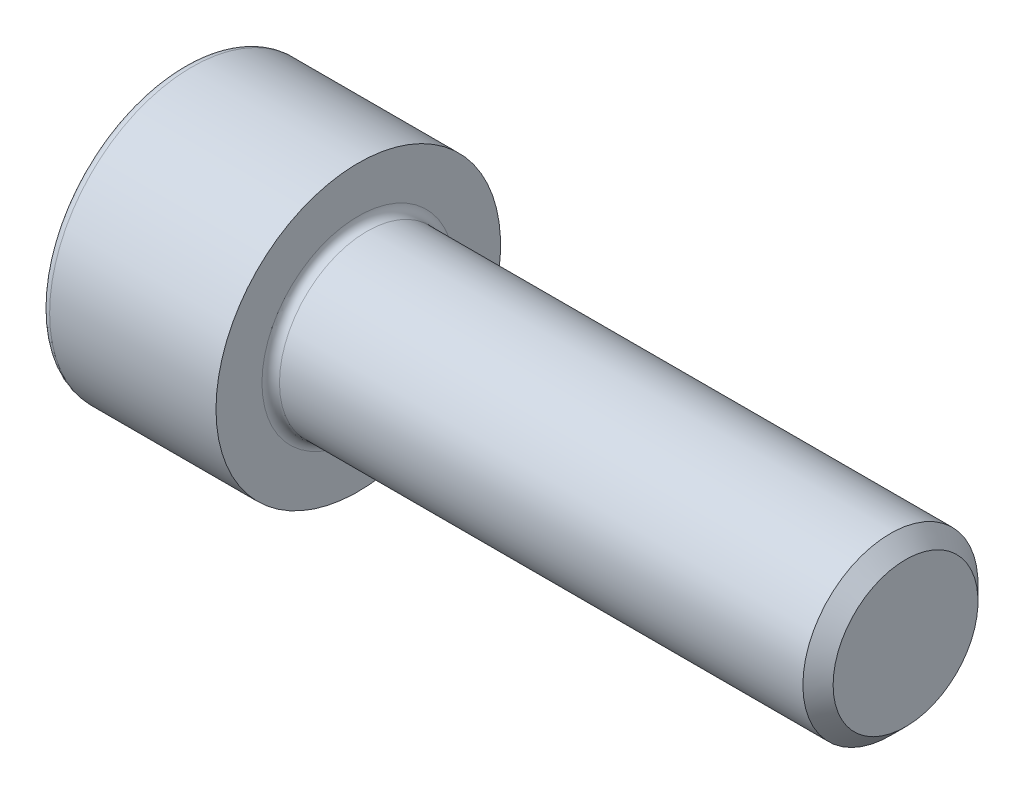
ISO-10303-21;
HEADER;
FILE_DESCRIPTION(('STEP AP214'),'2;1');
FILE_NAME('part.step','',(''),(''),'','','');
FILE_SCHEMA(('AUTOMOTIVE_DESIGN { 1 0 10303 214 1 1 1 1 }'));
ENDSEC;
DATA;
#1=APPLICATION_CONTEXT('core data for automotive mechanical design processes');
#2=APPLICATION_PROTOCOL_DEFINITION('international standard','automotive_design',2000,#1);
#3=PRODUCT_CONTEXT('',#1,'mechanical');
#4=PRODUCT('Part','Part','',(#3));
#5=PRODUCT_RELATED_PRODUCT_CATEGORY('part','',(#4));
#6=PRODUCT_DEFINITION_FORMATION('','',#4);
#7=PRODUCT_DEFINITION_CONTEXT('part definition',#1,'design');
#8=PRODUCT_DEFINITION('design','',#6,#7);
#9=PRODUCT_DEFINITION_SHAPE('','',#8);
#10=(LENGTH_UNIT() NAMED_UNIT(*) SI_UNIT(.MILLI.,.METRE.));
#11=(NAMED_UNIT(*) PLANE_ANGLE_UNIT() SI_UNIT($,.RADIAN.));
#12=(NAMED_UNIT(*) SI_UNIT($,.STERADIAN.) SOLID_ANGLE_UNIT());
#13=UNCERTAINTY_MEASURE_WITH_UNIT(LENGTH_MEASURE(1.E-05),#10,'distance_accuracy_value','');
#14=(GEOMETRIC_REPRESENTATION_CONTEXT(3) GLOBAL_UNCERTAINTY_ASSIGNED_CONTEXT((#13)) GLOBAL_UNIT_ASSIGNED_CONTEXT((#10,
#11,#12)) REPRESENTATION_CONTEXT('',''));
#15=CARTESIAN_POINT('',(0.,0.,0.));
#16=DIRECTION('',(0.,0.,1.));
#17=DIRECTION('',(1.,0.,0.));
#18=AXIS2_PLACEMENT_3D('',#15,#16,#17);
#19=CARTESIAN_POINT('',(0.,0.,0.));
#20=DIRECTION('',(-1.,0.,0.));
#21=DIRECTION('',(0.,0.,1.));
#22=AXIS2_PLACEMENT_3D('',#19,#20,#21);
#23=PLANE('',#22);
#24=DIRECTION('',(0.,-0.499999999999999,0.866025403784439));
#25=VECTOR('',#24,1.);
#26=CARTESIAN_POINT('',(0.,3.51894989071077,0.));
#27=LINE('',#26,#25);
#28=CARTESIAN_POINT('',(0.,3.51894989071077,0.));
#29=VERTEX_POINT('',#28);
#30=CARTESIAN_POINT('',(0.,1.75947494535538,3.04749999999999));
#31=VERTEX_POINT('',#30);
#32=EDGE_CURVE('E259',#29,#31,#27,.T.);
#33=ORIENTED_EDGE('',*,*,#32,.T.);
#34=DIRECTION('',(0.,1.,0.));
#35=VECTOR('',#34,1.);
#36=CARTESIAN_POINT('',(0.,-1.75947494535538,3.0475));
#37=LINE('',#36,#35);
#38=CARTESIAN_POINT('',(0.,-1.75947494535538,3.0475));
#39=VERTEX_POINT('',#38);
#40=EDGE_CURVE('E131',#39,#31,#37,.T.);
#41=ORIENTED_EDGE('',*,*,#40,.F.);
#42=DIRECTION('',(0.,-0.500000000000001,-0.866025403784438));
#43=VECTOR('',#42,1.);
#44=CARTESIAN_POINT('',(0.,-1.75947494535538,3.0475));
#45=LINE('',#44,#43);
#46=CARTESIAN_POINT('',(0.,-3.51894989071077,0.));
#47=VERTEX_POINT('',#46);
#48=EDGE_CURVE('E262',#39,#47,#45,.T.);
#49=ORIENTED_EDGE('',*,*,#48,.T.);
#50=DIRECTION('',(0.,0.499999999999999,-0.866025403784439));
#51=VECTOR('',#50,1.);
#52=CARTESIAN_POINT('',(0.,-3.51894989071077,0.));
#53=LINE('',#52,#51);
#54=CARTESIAN_POINT('',(0.,-1.75947494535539,-3.0475));
#55=VERTEX_POINT('',#54);
#56=EDGE_CURVE('E265',#47,#55,#53,.T.);
#57=ORIENTED_EDGE('',*,*,#56,.T.);
#58=DIRECTION('',(0.,-1.,0.));
#59=VECTOR('',#58,1.);
#60=CARTESIAN_POINT('',(0.,1.75947494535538,-3.04750000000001));
#61=LINE('',#60,#59);
#62=CARTESIAN_POINT('',(0.,1.75947494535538,-3.04750000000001));
#63=VERTEX_POINT('',#62);
#64=EDGE_CURVE('E268',#63,#55,#61,.T.);
#65=ORIENTED_EDGE('',*,*,#64,.F.);
#66=DIRECTION('',(0.,-0.500000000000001,-0.866025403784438));
#67=VECTOR('',#66,1.);
#68=CARTESIAN_POINT('',(0.,3.51894989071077,0.));
#69=LINE('',#68,#67);
#70=EDGE_CURVE('E126',#29,#63,#69,.T.);
#71=ORIENTED_EDGE('',*,*,#70,.F.);
#72=EDGE_LOOP('',(#33,#41,#49,#57,#65,#71));
#73=FACE_BOUND('',#72,.T.);
#74=CARTESIAN_POINT('',(0.,0.,0.));
#75=DIRECTION('',(-1.,0.,0.));
#76=DIRECTION('',(0.,0.,1.));
#77=AXIS2_PLACEMENT_3D('',#74,#75,#76);
#78=CIRCLE('',#77,6.1);
#79=CARTESIAN_POINT('',(0.,0.,6.1));
#80=VERTEX_POINT('',#79);
#81=EDGE_CURVE('E43',#80,#80,#78,.T.);
#82=ORIENTED_EDGE('',*,*,#81,.T.);
#83=EDGE_LOOP('',(#82));
#84=FACE_BOUND('',#83,.T.);
#85=ADVANCED_FACE('F35',(#73,#84),#23,.T.);
#86=CARTESIAN_POINT('',(-31.75,0.,0.));
#87=DIRECTION('',(-1.,0.,0.));
#88=DIRECTION('',(0.,0.,1.));
#89=AXIS2_PLACEMENT_3D('',#86,#87,#88);
#90=CYLINDRICAL_SURFACE('',#89,6.5);
#91=CARTESIAN_POINT('',(0.399999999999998,0.,0.));
#92=DIRECTION('',(-1.,0.,0.));
#93=DIRECTION('',(0.,0.,1.));
#94=AXIS2_PLACEMENT_3D('',#91,#92,#93);
#95=CIRCLE('',#94,6.5);
#96=CARTESIAN_POINT('',(0.399999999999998,0.,6.5));
#97=VERTEX_POINT('',#96);
#98=EDGE_CURVE('E11',#97,#97,#95,.F.);
#99=ORIENTED_EDGE('',*,*,#98,.T.);
#100=EDGE_LOOP('',(#99));
#101=FACE_BOUND('',#100,.T.);
#102=CARTESIAN_POINT('',(8.,0.,0.));
#103=DIRECTION('',(-1.,0.,0.));
#104=DIRECTION('',(0.,0.,1.));
#105=AXIS2_PLACEMENT_3D('',#102,#103,#104);
#106=CIRCLE('',#105,6.5);
#107=CARTESIAN_POINT('',(8.,0.,6.5));
#108=VERTEX_POINT('',#107);
#109=EDGE_CURVE('E149',#108,#108,#106,.T.);
#110=ORIENTED_EDGE('',*,*,#109,.T.);
#111=EDGE_LOOP('',(#110));
#112=FACE_BOUND('',#111,.T.);
#113=ADVANCED_FACE('F173',(#101,#112),#90,.T.);
#114=CARTESIAN_POINT('',(8.,6.5,0.));
#115=DIRECTION('',(1.,0.,0.));
#116=DIRECTION('',(0.,0.,-1.));
#117=AXIS2_PLACEMENT_3D('',#114,#115,#116);
#118=PLANE('',#117);
#119=CARTESIAN_POINT('',(8.,0.,0.));
#120=DIRECTION('',(1.,0.,0.));
#121=DIRECTION('',(0.,0.,-1.));
#122=AXIS2_PLACEMENT_3D('',#119,#120,#121);
#123=CIRCLE('',#122,4.39999999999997);
#124=CARTESIAN_POINT('',(8.,0.,-4.39999999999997));
#125=VERTEX_POINT('',#124);
#126=EDGE_CURVE('E152',#125,#125,#123,.F.);
#127=ORIENTED_EDGE('',*,*,#126,.T.);
#128=EDGE_LOOP('',(#127));
#129=FACE_BOUND('',#128,.T.);
#130=ORIENTED_EDGE('',*,*,#109,.F.);
#131=EDGE_LOOP('',(#130));
#132=FACE_BOUND('',#131,.T.);
#133=ADVANCED_FACE('F179',(#129,#132),#118,.T.);
#134=CARTESIAN_POINT('',(-31.75,0.,0.));
#135=DIRECTION('',(-1.,0.,0.));
#136=DIRECTION('',(0.,0.,1.));
#137=AXIS2_PLACEMENT_3D('',#134,#135,#136);
#138=CYLINDRICAL_SURFACE('',#137,3.99999999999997);
#139=CARTESIAN_POINT('',(8.4,0.,0.));
#140=DIRECTION('',(1.,0.,0.));
#141=DIRECTION('',(0.,0.,-1.));
#142=AXIS2_PLACEMENT_3D('',#139,#140,#141);
#143=CIRCLE('',#142,3.99999999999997);
#144=CARTESIAN_POINT('',(8.4,0.,-3.99999999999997));
#145=VERTEX_POINT('',#144);
#146=EDGE_CURVE('E155',#145,#145,#143,.T.);
#147=ORIENTED_EDGE('',*,*,#146,.T.);
#148=EDGE_LOOP('',(#147));
#149=FACE_BOUND('',#148,.T.);
#150=CARTESIAN_POINT('',(32.3095,0.,0.));
#151=DIRECTION('',(-1.,0.,0.));
#152=DIRECTION('',(0.,0.,1.));
#153=AXIS2_PLACEMENT_3D('',#150,#151,#152);
#154=CIRCLE('',#153,3.99999999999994);
#155=CARTESIAN_POINT('',(32.3095,0.,3.99999999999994));
#156=VERTEX_POINT('',#155);
#157=EDGE_CURVE('E146',#156,#156,#154,.T.);
#158=ORIENTED_EDGE('',*,*,#157,.T.);
#159=EDGE_LOOP('',(#158));
#160=FACE_BOUND('',#159,.T.);
#161=ADVANCED_FACE('F185',(#149,#160),#138,.T.);
#162=CARTESIAN_POINT('',(33.,0.,0.));
#163=DIRECTION('',(-1.,0.,0.));
#164=DIRECTION('',(0.,0.,1.));
#165=AXIS2_PLACEMENT_3D('',#162,#163,#164);
#166=CONICAL_SURFACE('',#165,3.3095,0.785398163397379);
#167=ORIENTED_EDGE('',*,*,#157,.F.);
#168=EDGE_LOOP('',(#167));
#169=FACE_BOUND('',#168,.T.);
#170=CARTESIAN_POINT('',(33.,0.,0.));
#171=DIRECTION('',(-1.,0.,0.));
#172=DIRECTION('',(0.,0.,1.));
#173=AXIS2_PLACEMENT_3D('',#170,#171,#172);
#174=CIRCLE('',#173,3.3095);
#175=CARTESIAN_POINT('',(33.,0.,3.3095));
#176=VERTEX_POINT('',#175);
#177=EDGE_CURVE('E142',#176,#176,#174,.T.);
#178=ORIENTED_EDGE('',*,*,#177,.T.);
#179=EDGE_LOOP('',(#178));
#180=FACE_BOUND('',#179,.T.);
#181=ADVANCED_FACE('F189',(#169,#180),#166,.T.);
#182=CARTESIAN_POINT('',(33.,3.3095,0.));
#183=DIRECTION('',(1.,0.,0.));
#184=DIRECTION('',(0.,0.,-1.));
#185=AXIS2_PLACEMENT_3D('',#182,#183,#184);
#186=PLANE('',#185);
#187=ORIENTED_EDGE('',*,*,#177,.F.);
#188=EDGE_LOOP('',(#187));
#189=FACE_BOUND('',#188,.T.);
#190=ADVANCED_FACE('F169',(#189),#186,.T.);
#191=CARTESIAN_POINT('',(8.4,0.,0.));
#192=DIRECTION('',(1.,0.,0.));
#193=DIRECTION('',(0.,0.,-1.));
#194=AXIS2_PLACEMENT_3D('',#191,#192,#193);
#195=TOROIDAL_SURFACE('',#194,4.39999999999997,0.4);
#196=ORIENTED_EDGE('',*,*,#146,.F.);
#197=EDGE_LOOP('',(#196));
#198=FACE_BOUND('',#197,.T.);
#199=ORIENTED_EDGE('',*,*,#126,.F.);
#200=EDGE_LOOP('',(#199));
#201=FACE_BOUND('',#200,.T.);
#202=ADVANCED_FACE('F162',(#198,#201),#195,.F.);
#203=CARTESIAN_POINT('',(0.399999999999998,0.,0.));
#204=DIRECTION('',(-1.,0.,0.));
#205=DIRECTION('',(0.,0.,1.));
#206=AXIS2_PLACEMENT_3D('',#203,#204,#205);
#207=TOROIDAL_SURFACE('',#206,6.1,0.4);
#208=ORIENTED_EDGE('',*,*,#98,.F.);
#209=EDGE_LOOP('',(#208));
#210=FACE_BOUND('',#209,.T.);
#211=ORIENTED_EDGE('',*,*,#81,.F.);
#212=EDGE_LOOP('',(#211));
#213=FACE_BOUND('',#212,.T.);
#214=ADVANCED_FACE('F37',(#210,#213),#207,.T.);
#215=CARTESIAN_POINT('',(4.,3.51894989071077,0.));
#216=DIRECTION('',(0.,-0.866025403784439,-0.499999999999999));
#217=DIRECTION('',(0.,0.499999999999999,-0.866025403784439));
#218=AXIS2_PLACEMENT_3D('',#215,#216,#217);
#219=PLANE('',#218);
#220=ORIENTED_EDGE('',*,*,#32,.F.);
#221=DIRECTION('',(-1.,0.,0.));
#222=VECTOR('',#221,1.);
#223=CARTESIAN_POINT('',(4.,3.51894989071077,0.));
#224=LINE('',#223,#222);
#225=CARTESIAN_POINT('',(4.,3.51894989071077,0.));
#226=VERTEX_POINT('',#225);
#227=EDGE_CURVE('E249',#226,#29,#224,.T.);
#228=ORIENTED_EDGE('',*,*,#227,.F.);
#229=DIRECTION('',(0.,-0.499999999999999,0.866025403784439));
#230=VECTOR('',#229,1.);
#231=CARTESIAN_POINT('',(4.,3.51894989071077,0.));
#232=LINE('',#231,#230);
#233=CARTESIAN_POINT('',(4.,2.63921241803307,1.52374999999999));
#234=VERTEX_POINT('',#233);
#235=EDGE_CURVE('E118',#226,#234,#232,.T.);
#236=ORIENTED_EDGE('',*,*,#235,.T.);
#237=CARTESIAN_POINT('',(4.,1.75947494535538,3.04749999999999));
#238=VERTEX_POINT('',#237);
#239=EDGE_CURVE('E109',#234,#238,#232,.T.);
#240=ORIENTED_EDGE('',*,*,#239,.T.);
#241=DIRECTION('',(-1.,0.,0.));
#242=VECTOR('',#241,1.);
#243=CARTESIAN_POINT('',(4.,1.75947494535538,3.04749999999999));
#244=LINE('',#243,#242);
#245=EDGE_CURVE('E123',#238,#31,#244,.T.);
#246=ORIENTED_EDGE('',*,*,#245,.T.);
#247=EDGE_LOOP('',(#220,#228,#236,#240,#246));
#248=FACE_BOUND('',#247,.T.);
#249=ADVANCED_FACE('F122',(#248),#219,.T.);
#250=CARTESIAN_POINT('',(4.,-1.75947494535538,3.0475));
#251=DIRECTION('',(0.,0.,1.));
#252=DIRECTION('',(0.,-1.,0.));
#253=AXIS2_PLACEMENT_3D('',#250,#251,#252);
#254=PLANE('',#253);
#255=ORIENTED_EDGE('',*,*,#40,.T.);
#256=ORIENTED_EDGE('',*,*,#245,.F.);
#257=DIRECTION('',(0.,1.,0.));
#258=VECTOR('',#257,1.);
#259=CARTESIAN_POINT('',(4.,-1.75947494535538,3.0475));
#260=LINE('',#259,#258);
#261=CARTESIAN_POINT('',(4.,0.,3.0475));
#262=VERTEX_POINT('',#261);
#263=EDGE_CURVE('E106',#262,#238,#260,.T.);
#264=ORIENTED_EDGE('',*,*,#263,.F.);
#265=CARTESIAN_POINT('',(4.,-1.75947494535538,3.0475));
#266=VERTEX_POINT('',#265);
#267=EDGE_CURVE('E117',#266,#262,#260,.T.);
#268=ORIENTED_EDGE('',*,*,#267,.F.);
#269=DIRECTION('',(-1.,0.,0.));
#270=VECTOR('',#269,1.);
#271=CARTESIAN_POINT('',(4.,-1.75947494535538,3.0475));
#272=LINE('',#271,#270);
#273=EDGE_CURVE('E133',#266,#39,#272,.T.);
#274=ORIENTED_EDGE('',*,*,#273,.T.);
#275=EDGE_LOOP('',(#255,#256,#264,#268,#274));
#276=FACE_BOUND('',#275,.T.);
#277=ADVANCED_FACE('F128',(#276),#254,.F.);
#278=CARTESIAN_POINT('',(4.,-1.75947494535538,3.0475));
#279=DIRECTION('',(0.,0.866025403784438,-0.500000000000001));
#280=DIRECTION('',(0.,0.500000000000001,0.866025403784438));
#281=AXIS2_PLACEMENT_3D('',#278,#279,#280);
#282=PLANE('',#281);
#283=ORIENTED_EDGE('',*,*,#48,.F.);
#284=ORIENTED_EDGE('',*,*,#273,.F.);
#285=DIRECTION('',(0.,-0.500000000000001,-0.866025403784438));
#286=VECTOR('',#285,1.);
#287=CARTESIAN_POINT('',(4.,-1.75947494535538,3.0475));
#288=LINE('',#287,#286);
#289=CARTESIAN_POINT('',(4.,-2.63921241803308,1.52375));
#290=VERTEX_POINT('',#289);
#291=EDGE_CURVE('E288',#266,#290,#288,.T.);
#292=ORIENTED_EDGE('',*,*,#291,.T.);
#293=CARTESIAN_POINT('',(4.,-3.51894989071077,0.));
#294=VERTEX_POINT('',#293);
#295=EDGE_CURVE('E277',#290,#294,#288,.T.);
#296=ORIENTED_EDGE('',*,*,#295,.T.);
#297=DIRECTION('',(-1.,0.,0.));
#298=VECTOR('',#297,1.);
#299=CARTESIAN_POINT('',(4.,-3.51894989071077,0.));
#300=LINE('',#299,#298);
#301=EDGE_CURVE('E138',#294,#47,#300,.T.);
#302=ORIENTED_EDGE('',*,*,#301,.T.);
#303=EDGE_LOOP('',(#283,#284,#292,#296,#302));
#304=FACE_BOUND('',#303,.T.);
#305=ADVANCED_FACE('F203',(#304),#282,.T.);
#306=CARTESIAN_POINT('',(4.,-3.51894989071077,0.));
#307=DIRECTION('',(0.,0.86602540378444,0.499999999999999));
#308=DIRECTION('',(0.,-0.499999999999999,0.866025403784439));
#309=AXIS2_PLACEMENT_3D('',#306,#307,#308);
#310=PLANE('',#309);
#311=ORIENTED_EDGE('',*,*,#56,.F.);
#312=ORIENTED_EDGE('',*,*,#301,.F.);
#313=DIRECTION('',(0.,0.499999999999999,-0.866025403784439));
#314=VECTOR('',#313,1.);
#315=CARTESIAN_POINT('',(4.,-3.51894989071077,0.));
#316=LINE('',#315,#314);
#317=CARTESIAN_POINT('',(4.,-2.63921241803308,-1.52375));
#318=VERTEX_POINT('',#317);
#319=EDGE_CURVE('E255',#294,#318,#316,.T.);
#320=ORIENTED_EDGE('',*,*,#319,.T.);
#321=CARTESIAN_POINT('',(4.,-1.75947494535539,-3.0475));
#322=VERTEX_POINT('',#321);
#323=EDGE_CURVE('E287',#318,#322,#316,.T.);
#324=ORIENTED_EDGE('',*,*,#323,.T.);
#325=DIRECTION('',(-1.,0.,0.));
#326=VECTOR('',#325,1.);
#327=CARTESIAN_POINT('',(4.,-1.75947494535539,-3.0475));
#328=LINE('',#327,#326);
#329=EDGE_CURVE('E248',#322,#55,#328,.T.);
#330=ORIENTED_EDGE('',*,*,#329,.T.);
#331=EDGE_LOOP('',(#311,#312,#320,#324,#330));
#332=FACE_BOUND('',#331,.T.);
#333=ADVANCED_FACE('F206',(#332),#310,.T.);
#334=CARTESIAN_POINT('',(4.,1.75947494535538,-3.04750000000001));
#335=DIRECTION('',(0.,0.,-1.));
#336=DIRECTION('',(0.,1.,0.));
#337=AXIS2_PLACEMENT_3D('',#334,#335,#336);
#338=PLANE('',#337);
#339=ORIENTED_EDGE('',*,*,#64,.T.);
#340=ORIENTED_EDGE('',*,*,#329,.F.);
#341=DIRECTION('',(0.,-1.,0.));
#342=VECTOR('',#341,1.);
#343=CARTESIAN_POINT('',(4.,1.75947494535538,-3.04750000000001));
#344=LINE('',#343,#342);
#345=CARTESIAN_POINT('',(4.,0.,-3.0475));
#346=VERTEX_POINT('',#345);
#347=EDGE_CURVE('E252',#346,#322,#344,.T.);
#348=ORIENTED_EDGE('',*,*,#347,.F.);
#349=CARTESIAN_POINT('',(4.,1.75947494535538,-3.04750000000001));
#350=VERTEX_POINT('',#349);
#351=EDGE_CURVE('E50',#350,#346,#344,.T.);
#352=ORIENTED_EDGE('',*,*,#351,.F.);
#353=DIRECTION('',(-1.,0.,0.));
#354=VECTOR('',#353,1.);
#355=CARTESIAN_POINT('',(4.,1.75947494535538,-3.04750000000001));
#356=LINE('',#355,#354);
#357=EDGE_CURVE('E245',#350,#63,#356,.T.);
#358=ORIENTED_EDGE('',*,*,#357,.T.);
#359=EDGE_LOOP('',(#339,#340,#348,#352,#358));
#360=FACE_BOUND('',#359,.T.);
#361=ADVANCED_FACE('F210',(#360),#338,.F.);
#362=CARTESIAN_POINT('',(4.,3.51894989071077,0.));
#363=DIRECTION('',(0.,0.866025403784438,-0.500000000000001));
#364=DIRECTION('',(0.,0.500000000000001,0.866025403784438));
#365=AXIS2_PLACEMENT_3D('',#362,#363,#364);
#366=PLANE('',#365);
#367=ORIENTED_EDGE('',*,*,#70,.T.);
#368=ORIENTED_EDGE('',*,*,#357,.F.);
#369=DIRECTION('',(0.,-0.500000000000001,-0.866025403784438));
#370=VECTOR('',#369,1.);
#371=CARTESIAN_POINT('',(4.,3.51894989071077,0.));
#372=LINE('',#371,#370);
#373=CARTESIAN_POINT('',(4.,2.63921241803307,-1.52375));
#374=VERTEX_POINT('',#373);
#375=EDGE_CURVE('E235',#374,#350,#372,.T.);
#376=ORIENTED_EDGE('',*,*,#375,.F.);
#377=EDGE_CURVE('E241',#226,#374,#372,.T.);
#378=ORIENTED_EDGE('',*,*,#377,.F.);
#379=ORIENTED_EDGE('',*,*,#227,.T.);
#380=EDGE_LOOP('',(#367,#368,#376,#378,#379));
#381=FACE_BOUND('',#380,.T.);
#382=ADVANCED_FACE('F214',(#381),#366,.F.);
#383=CARTESIAN_POINT('',(4.,5.27842483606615,-3.04750000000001));
#384=DIRECTION('',(1.,0.,0.));
#385=DIRECTION('',(0.,0.,-1.));
#386=AXIS2_PLACEMENT_3D('',#383,#384,#385);
#387=PLANE('',#386);
#388=ORIENTED_EDGE('',*,*,#347,.T.);
#389=ORIENTED_EDGE('',*,*,#323,.F.);
#390=CARTESIAN_POINT('',(4.,0.,0.));
#391=DIRECTION('',(-1.,0.,0.));
#392=DIRECTION('',(0.,0.,1.));
#393=AXIS2_PLACEMENT_3D('',#390,#391,#392);
#394=CIRCLE('',#393,3.0475);
#395=EDGE_CURVE('E283',#346,#318,#394,.T.);
#396=ORIENTED_EDGE('',*,*,#395,.F.);
#397=EDGE_LOOP('',(#388,#389,#396));
#398=FACE_BOUND('',#397,.T.);
#399=ADVANCED_FACE('F218',(#398),#387,.F.);
#400=ORIENTED_EDGE('',*,*,#319,.F.);
#401=ORIENTED_EDGE('',*,*,#295,.F.);
#402=EDGE_CURVE('E136',#318,#290,#394,.T.);
#403=ORIENTED_EDGE('',*,*,#402,.F.);
#404=EDGE_LOOP('',(#400,#401,#403));
#405=FACE_BOUND('',#404,.T.);
#406=ADVANCED_FACE('F221',(#405),#387,.F.);
#407=ORIENTED_EDGE('',*,*,#291,.F.);
#408=ORIENTED_EDGE('',*,*,#267,.T.);
#409=EDGE_CURVE('E132',#290,#262,#394,.T.);
#410=ORIENTED_EDGE('',*,*,#409,.F.);
#411=EDGE_LOOP('',(#407,#408,#410));
#412=FACE_BOUND('',#411,.T.);
#413=ADVANCED_FACE('F226',(#412),#387,.F.);
#414=ORIENTED_EDGE('',*,*,#263,.T.);
#415=ORIENTED_EDGE('',*,*,#239,.F.);
#416=EDGE_CURVE('E112',#262,#234,#394,.T.);
#417=ORIENTED_EDGE('',*,*,#416,.F.);
#418=EDGE_LOOP('',(#414,#415,#417));
#419=FACE_BOUND('',#418,.T.);
#420=ADVANCED_FACE('F108',(#419),#387,.F.);
#421=ORIENTED_EDGE('',*,*,#235,.F.);
#422=ORIENTED_EDGE('',*,*,#377,.T.);
#423=EDGE_CURVE('E143',#234,#374,#394,.T.);
#424=ORIENTED_EDGE('',*,*,#423,.F.);
#425=EDGE_LOOP('',(#421,#422,#424));
#426=FACE_BOUND('',#425,.T.);
#427=ADVANCED_FACE('F229',(#426),#387,.F.);
#428=ORIENTED_EDGE('',*,*,#375,.T.);
#429=ORIENTED_EDGE('',*,*,#351,.T.);
#430=EDGE_CURVE('E238',#374,#346,#394,.T.);
#431=ORIENTED_EDGE('',*,*,#430,.F.);
#432=EDGE_LOOP('',(#428,#429,#431));
#433=FACE_BOUND('',#432,.T.);
#434=ADVANCED_FACE('F199',(#433),#387,.F.);
#435=CARTESIAN_POINT('',(4.,0.,0.));
#436=DIRECTION('',(-1.,0.,0.));
#437=DIRECTION('',(0.,0.,1.));
#438=AXIS2_PLACEMENT_3D('',#435,#436,#437);
#439=CONICAL_SURFACE('',#438,3.0475,1.04719755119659);
#440=CARTESIAN_POINT('',(5.75947494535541,0.,0.));
#441=VERTEX_POINT('',#440);
#442=VERTEX_LOOP('',#441);
#443=FACE_BOUND('',#442,.T.);
#444=ORIENTED_EDGE('',*,*,#416,.T.);
#445=ORIENTED_EDGE('',*,*,#423,.T.);
#446=ORIENTED_EDGE('',*,*,#430,.T.);
#447=ORIENTED_EDGE('',*,*,#395,.T.);
#448=ORIENTED_EDGE('',*,*,#402,.T.);
#449=ORIENTED_EDGE('',*,*,#409,.T.);
#450=EDGE_LOOP('',(#444,#445,#446,#447,#448,#449));
#451=FACE_BOUND('',#450,.T.);
#452=ADVANCED_FACE('F197',(#443,#451),#439,.F.);
#453=CLOSED_SHELL('',(#85,#113,#133,#161,#181,#190,#202,#214,#249,#277,#305,#333,#361,#382,#399,
#406,#413,#420,#427,#434,#452));
#454=MANIFOLD_SOLID_BREP('B2',#453);
#455=ADVANCED_BREP_SHAPE_REPRESENTATION('',(#18,#454),#14);
#456=SHAPE_DEFINITION_REPRESENTATION(#9,#455);
ENDSEC;
END-ISO-10303-21;
